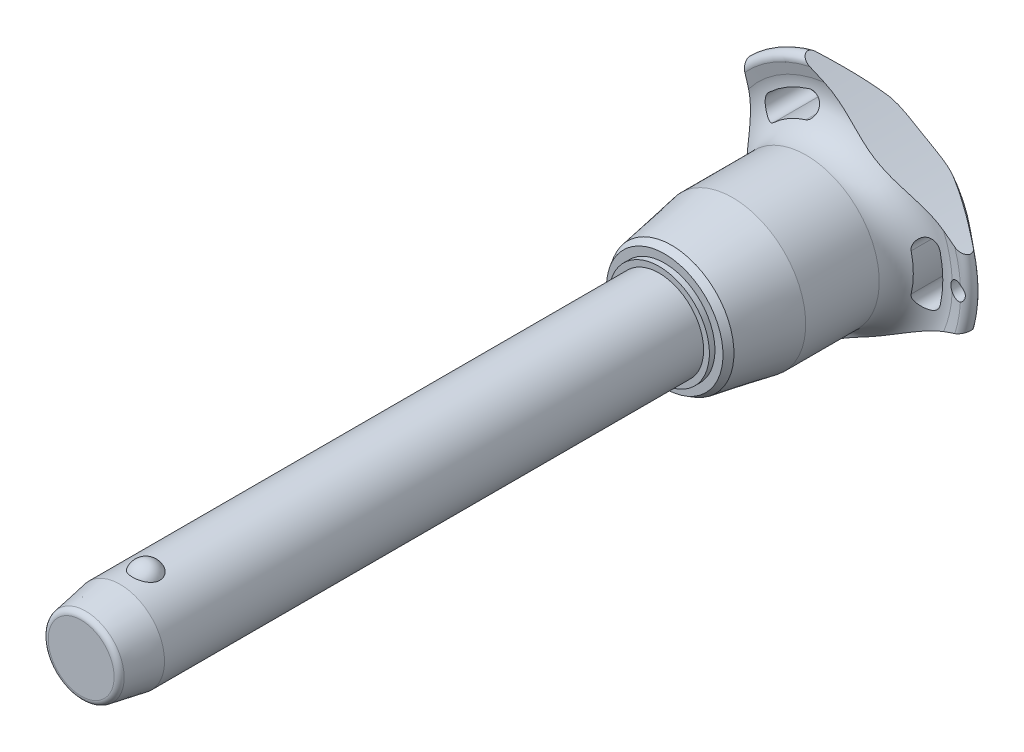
from build123d import *

# Parameters (mm, degrees)
SKETCH1_R           = 8
BOSS_EXTRUDE1_DEPTH = 90
SKETCH2_R           = 7
BOSS_EXTRUDE2_DEPTH = 39.7
BOSS_EXTRUDE3_START = 14
SKETCH1_2_R         = 8
BOSS_EXTRUDE3_DEPTH = 14
CHAMFER1_SIZE       = 7
CHAMFER1_SIZE2      = 1.234288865
FILLET1_R           = 1
SKETCH6_R           = 144.275
CUT_EXTRUDE1_DEPTH  = 134.999042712
CIRPATTERN1_COUNT   = 3
SKETCH7_R           = 1.5
CUT_EXTRUDE2_DEPTH  = 134.849189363


with BuildPart() as part:
    # Sketch1 → Boss-Extrude1 (new body)
    with BuildSketch(Plane.XY):
        Circle(SKETCH1_R)
    extrude(amount=-BOSS_EXTRUDE1_DEPTH)

    # Sketch2 → Boss-Extrude2 (add)
    with BuildSketch(Plane(origin=(0, 0, -90), x_dir=(-1, 0, 0), z_dir=(0, 0, -1))):
        Circle(SKETCH2_R)
    extrude(amount=BOSS_EXTRUDE2_DEPTH)

    # Sketch3 → Revolve1 (revolve)
    with BuildSketch(Plane(origin=(0, 0, 0), x_dir=(0, 0, -1), z_dir=(1, 0, 0))):
        with BuildLine():
            Line((-2.387467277, 9.5), (-2.387467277, 4.2))
            ThreePointArc((-2.387467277, 4.2), (0.262532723, 6.85), (-2.387467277, 9.5))
        make_face()
        with BuildLine():
            Line((-2.387467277, -4.2), (-2.387467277, -9.5))
            ThreePointArc((-2.387467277, -9.5), (0.262532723, -6.85), (-2.387467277, -4.2))
        make_face()
    revolve(axis=Axis((0, -4.2, 2.387467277), (0, 1, 0)))

    # Sketch1_2 → Boss-Extrude3 (add)
    with BuildSketch(Plane.XY.offset(BOSS_EXTRUDE3_START)):
        Circle(SKETCH1_2_R)
    extrude(amount=-BOSS_EXTRUDE3_DEPTH)

    # Chamfer1
    chamfer1_edges = [part.edges().sort_by_distance(p)[0] for p in [
        (-8, 0, 14),
    ]]
    chamfer1_side = [part.faces().sort_by_distance(p)[0] for p in [
        (-8, 0, -38),
    ]]
    chamfer(chamfer1_edges, length=CHAMFER1_SIZE, length2=CHAMFER1_SIZE2, reference=chamfer1_side[0])

    # Fillet1
    fillet1_edges = [part.edges().sort_by_distance(p)[0] for p in [
        (-6.765711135, 0, 14),
        (7, 0, -129.7),
    ]]
    fillet(fillet1_edges, radius=FILLET1_R)

    # Sketch4 → Revolve2 (revolve)
    with BuildSketch(Plane(origin=(0, 0, 0), x_dir=(0, 0, -1), z_dir=(1, 0, 0)), mode=Mode.PRIVATE) as revolve2_sk:
        Polygon((90, 0), (90, 9.044607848), (91, 9.044607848), (91, 10.490707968), (92.25235944, 11.213758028), (103.233333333, 13.15), (116.466666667, 13.15), (116.466666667, 0), align=None)
    revolve(revolve2_sk.sketch.rotate(Axis((0, 0, -116.466666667), (0, 0, 1)), 90), axis=Axis((0, 0, -116.466666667), (0, 0, 1)))

    # Sketch5 → Revolve3 (revolve)
    with BuildSketch(Plane(origin=(0, 0, 0), x_dir=(0, 0, -1), z_dir=(1, 0, 0)), mode=Mode.PRIVATE) as revolve3_sk:
        with BuildLine():
            Line((122.32877039, 20.428960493), (121.910912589, 22.344207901))
            ThreePointArc((121.910912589, 22.344207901), (122.554394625, 23.677136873), (124.002586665, 23.371345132))
            Line((124.002586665, 23.371345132), (129.141488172, 17.247040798))
            ThreePointArc((129.141488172, 17.247040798), (129.7, 15.584758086), (128.978803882, 13.986322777))
            ThreePointArc((128.978803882, 13.986322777), (124.617427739, 7.589034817), (123.083333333, 0))
            Line((123.083333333, 0), (116.466666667, 0))
            Line((116.466666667, 0), (116.466666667, 13.15))
            ThreePointArc((116.466666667, 13.15), (121.139661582, 15.38660811), (122.32877039, 20.428960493))
        make_face()
    revolve(revolve3_sk.sketch.rotate(Axis((0, 0, -123.083333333), (0, 0, 1)), 90), axis=Axis((0, 0, -123.083333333), (0, 0, 1)))

    # Sketch6 → Cut-Extrude1 (cut, through all)
    with BuildSketch(Plane.XY):
        with Locations((-159.975, 0)):
            Circle(SKETCH6_R)
        with BuildLine():
            ThreePointArc((18.131206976, -4.190753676), (18.60922037, 0), (18.131206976, 4.190753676))
            ThreePointArc((18.131206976, 4.190753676), (15.94840906, 5.553949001), (14.585213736, 3.371151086))
            ThreePointArc((14.585213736, 3.371151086), (14.969740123, 0), (14.585213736, -3.371151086))
            ThreePointArc((14.585213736, -3.371151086), (15.94840906, -5.553949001), (18.131206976, -4.190753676))
        make_face()
    cut_extrude1 = extrude(amount=-CUT_EXTRUDE1_DEPTH, mode=Mode.SUBTRACT)

    # CirPattern1: Cut-Extrude1 ×3 about axis
    cirpattern1_axis = Axis((0, 0, 0), (0, 0, 1))
    for i in range(1, CIRPATTERN1_COUNT):
        add(cut_extrude1.rotate(cirpattern1_axis, i * 360 / CIRPATTERN1_COUNT), mode=Mode.SUBTRACT)

    # Sketch7 → Cut-Extrude2 (cut, through all)
    with BuildSketch(Plane.XY):
        with Locations(Location((21.60922037, 0, 0), (0, 0, 297.620773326))):
            Circle(SKETCH7_R)
    extrude(amount=-CUT_EXTRUDE2_DEPTH, mode=Mode.SUBTRACT)


solid = part.part
